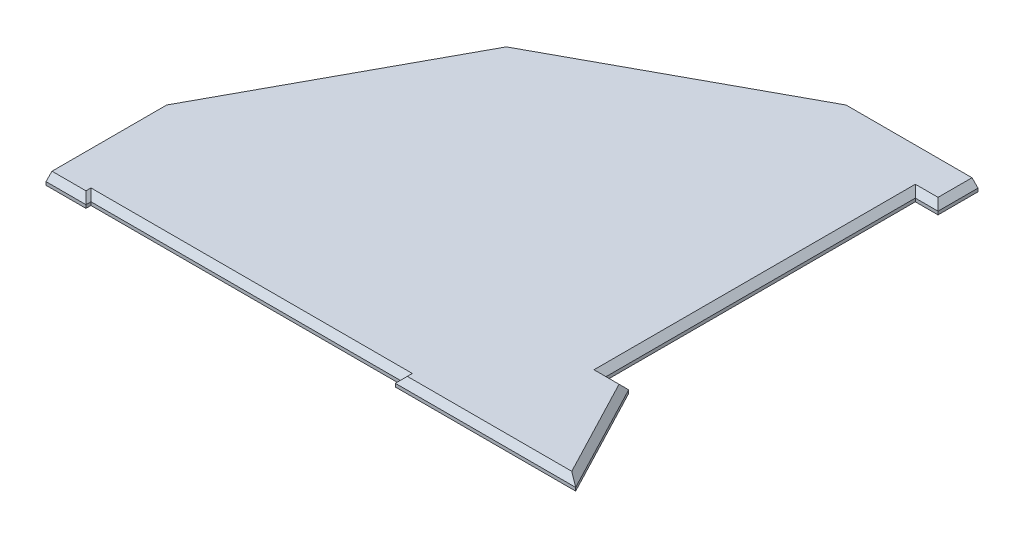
ISO-10303-21;
HEADER;
FILE_DESCRIPTION(('STEP AP214'),'2;1');
FILE_NAME('part.step','',(''),(''),'','','');
FILE_SCHEMA(('AUTOMOTIVE_DESIGN { 1 0 10303 214 1 1 1 1 }'));
ENDSEC;
DATA;
#1=APPLICATION_CONTEXT('core data for automotive mechanical design processes');
#2=APPLICATION_PROTOCOL_DEFINITION('international standard','automotive_design',2000,#1);
#3=PRODUCT_CONTEXT('',#1,'mechanical');
#4=PRODUCT('Part','Part','',(#3));
#5=PRODUCT_RELATED_PRODUCT_CATEGORY('part','',(#4));
#6=PRODUCT_DEFINITION_FORMATION('','',#4);
#7=PRODUCT_DEFINITION_CONTEXT('part definition',#1,'design');
#8=PRODUCT_DEFINITION('design','',#6,#7);
#9=PRODUCT_DEFINITION_SHAPE('','',#8);
#10=(LENGTH_UNIT() NAMED_UNIT(*) SI_UNIT(.MILLI.,.METRE.));
#11=(NAMED_UNIT(*) PLANE_ANGLE_UNIT() SI_UNIT($,.RADIAN.));
#12=(NAMED_UNIT(*) SI_UNIT($,.STERADIAN.) SOLID_ANGLE_UNIT());
#13=UNCERTAINTY_MEASURE_WITH_UNIT(LENGTH_MEASURE(1.E-05),#10,'distance_accuracy_value','');
#14=(GEOMETRIC_REPRESENTATION_CONTEXT(3) GLOBAL_UNCERTAINTY_ASSIGNED_CONTEXT((#13)) GLOBAL_UNIT_ASSIGNED_CONTEXT((#10,
#11,#12)) REPRESENTATION_CONTEXT('',''));
#15=CARTESIAN_POINT('',(0.,0.,0.));
#16=DIRECTION('',(0.,0.,1.));
#17=DIRECTION('',(1.,0.,0.));
#18=AXIS2_PLACEMENT_3D('',#15,#16,#17);
#19=CARTESIAN_POINT('',(145.16828136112,19.05,-591.552652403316));
#20=DIRECTION('',(0.476973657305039,0.,0.878917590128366));
#21=DIRECTION('',(0.878917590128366,0.,-0.47697365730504));
#22=AXIS2_PLACEMENT_3D('',#19,#20,#21);
#23=PLANE('',#22);
#24=DIRECTION('',(-0.878917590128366,0.,0.476973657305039));
#25=VECTOR('',#24,1.);
#26=CARTESIAN_POINT('',(145.16828136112,-19.05,-591.552652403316));
#27=LINE('',#26,#25);
#28=CARTESIAN_POINT('',(145.16828136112,-19.05,-591.552652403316));
#29=VERTEX_POINT('',#28);
#30=CARTESIAN_POINT('',(-405.744758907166,-19.05,-292.581496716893));
#31=VERTEX_POINT('',#30);
#32=EDGE_CURVE('E236',#29,#31,#27,.T.);
#33=ORIENTED_EDGE('',*,*,#32,.T.);
#34=DIRECTION('',(0.,-1.,0.));
#35=VECTOR('',#34,1.);
#36=CARTESIAN_POINT('',(-405.744758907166,19.05,-292.581496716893));
#37=LINE('',#36,#35);
#38=CARTESIAN_POINT('',(-405.744758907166,19.05,-292.581496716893));
#39=VERTEX_POINT('',#38);
#40=EDGE_CURVE('E218',#39,#31,#37,.T.);
#41=ORIENTED_EDGE('',*,*,#40,.F.);
#42=DIRECTION('',(-0.878917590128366,0.,0.476973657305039));
#43=VECTOR('',#42,1.);
#44=CARTESIAN_POINT('',(145.16828136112,19.05,-591.552652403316));
#45=LINE('',#44,#43);
#46=CARTESIAN_POINT('',(145.16828136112,19.05,-591.552652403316));
#47=VERTEX_POINT('',#46);
#48=EDGE_CURVE('E227',#47,#39,#45,.T.);
#49=ORIENTED_EDGE('',*,*,#48,.F.);
#50=DIRECTION('',(0.,-1.,0.));
#51=VECTOR('',#50,1.);
#52=CARTESIAN_POINT('',(145.16828136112,19.05,-591.552652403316));
#53=LINE('',#52,#51);
#54=EDGE_CURVE('E391',#47,#29,#53,.T.);
#55=ORIENTED_EDGE('',*,*,#54,.T.);
#56=EDGE_LOOP('',(#33,#41,#49,#55));
#57=FACE_BOUND('',#56,.T.);
#58=ADVANCED_FACE('F44',(#57),#23,.F.);
#59=CARTESIAN_POINT('',(-405.744758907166,19.05,-292.581496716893));
#60=DIRECTION('',(0.878917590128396,0.,0.476973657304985));
#61=DIRECTION('',(0.476973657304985,0.,-0.878917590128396));
#62=AXIS2_PLACEMENT_3D('',#59,#60,#61);
#63=PLANE('',#62);
#64=DIRECTION('',(-0.476973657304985,0.,0.878917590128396));
#65=VECTOR('',#64,1.);
#66=CARTESIAN_POINT('',(-405.744758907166,-19.05,-292.581496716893));
#67=LINE('',#66,#65);
#68=CARTESIAN_POINT('',(-704.715914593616,-19.05,258.331543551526));
#69=VERTEX_POINT('',#68);
#70=EDGE_CURVE('E402',#31,#69,#67,.T.);
#71=ORIENTED_EDGE('',*,*,#70,.T.);
#72=DIRECTION('',(0.,-1.,0.));
#73=VECTOR('',#72,1.);
#74=CARTESIAN_POINT('',(-704.715914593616,19.05,258.331543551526));
#75=LINE('',#74,#73);
#76=CARTESIAN_POINT('',(-704.715914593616,19.05,258.331543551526));
#77=VERTEX_POINT('',#76);
#78=EDGE_CURVE('E225',#77,#69,#75,.T.);
#79=ORIENTED_EDGE('',*,*,#78,.F.);
#80=DIRECTION('',(-0.476973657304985,0.,0.878917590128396));
#81=VECTOR('',#80,1.);
#82=CARTESIAN_POINT('',(-405.744758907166,19.05,-292.581496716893));
#83=LINE('',#82,#81);
#84=EDGE_CURVE('E214',#39,#77,#83,.T.);
#85=ORIENTED_EDGE('',*,*,#84,.F.);
#86=ORIENTED_EDGE('',*,*,#40,.T.);
#87=EDGE_LOOP('',(#71,#79,#85,#86));
#88=FACE_BOUND('',#87,.T.);
#89=ADVANCED_FACE('F220',(#88),#63,.F.);
#90=CARTESIAN_POINT('',(-704.715914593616,19.05,560.23764759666));
#91=DIRECTION('',(1.,0.,0.));
#92=DIRECTION('',(0.,0.,-1.));
#93=AXIS2_PLACEMENT_3D('',#90,#91,#92);
#94=PLANE('',#93);
#95=DIRECTION('',(0.,0.,1.));
#96=VECTOR('',#95,1.);
#97=CARTESIAN_POINT('',(-704.715914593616,-19.05,560.23764759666));
#98=LINE('',#97,#96);
#99=CARTESIAN_POINT('',(-704.715914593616,-19.05,545.23764759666));
#100=VERTEX_POINT('',#99);
#101=EDGE_CURVE('E401',#69,#100,#98,.T.);
#102=ORIENTED_EDGE('',*,*,#101,.T.);
#103=DIRECTION('',(0.,0.70710678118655,0.707106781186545));
#104=VECTOR('',#103,1.);
#105=CARTESIAN_POINT('',(-704.715914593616,-4.04999999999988,560.23764759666));
#106=LINE('',#105,#104);
#107=CARTESIAN_POINT('',(-704.715914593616,-4.04999999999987,560.23764759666));
#108=VERTEX_POINT('',#107);
#109=EDGE_CURVE('E271',#100,#108,#106,.T.);
#110=ORIENTED_EDGE('',*,*,#109,.T.);
#111=DIRECTION('',(0.,-1.,0.));
#112=VECTOR('',#111,1.);
#113=CARTESIAN_POINT('',(-704.715914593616,19.05,560.23764759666));
#114=LINE('',#113,#112);
#115=CARTESIAN_POINT('',(-704.715914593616,4.0500000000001,560.23764759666));
#116=VERTEX_POINT('',#115);
#117=EDGE_CURVE('E245',#116,#108,#114,.T.);
#118=ORIENTED_EDGE('',*,*,#117,.F.);
#119=DIRECTION('',(0.,-0.707106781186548,0.707106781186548));
#120=VECTOR('',#119,1.);
#121=CARTESIAN_POINT('',(-704.715914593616,19.05,545.23764759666));
#122=LINE('',#121,#120);
#123=CARTESIAN_POINT('',(-704.715914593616,19.05,545.23764759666));
#124=VERTEX_POINT('',#123);
#125=EDGE_CURVE('E267',#116,#124,#122,.F.);
#126=ORIENTED_EDGE('',*,*,#125,.T.);
#127=DIRECTION('',(0.,0.,1.));
#128=VECTOR('',#127,1.);
#129=CARTESIAN_POINT('',(-704.715914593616,19.05,560.23764759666));
#130=LINE('',#129,#128);
#131=EDGE_CURVE('E223',#77,#124,#130,.T.);
#132=ORIENTED_EDGE('',*,*,#131,.F.);
#133=ORIENTED_EDGE('',*,*,#78,.T.);
#134=EDGE_LOOP('',(#102,#110,#118,#126,#132,#133));
#135=FACE_BOUND('',#134,.T.);
#136=ADVANCED_FACE('F526',(#135),#94,.F.);
#137=CARTESIAN_POINT('',(-604.715914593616,19.05,560.23764759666));
#138=DIRECTION('',(0.,0.,-1.));
#139=DIRECTION('',(-1.,0.,0.));
#140=AXIS2_PLACEMENT_3D('',#137,#138,#139);
#141=PLANE('',#140);
#142=ORIENTED_EDGE('',*,*,#117,.T.);
#143=DIRECTION('',(1.,0.,0.));
#144=VECTOR('',#143,1.);
#145=CARTESIAN_POINT('',(-604.715914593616,-4.04999999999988,560.23764759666));
#146=LINE('',#145,#144);
#147=CARTESIAN_POINT('',(-604.715914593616,-4.04999999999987,560.23764759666));
#148=VERTEX_POINT('',#147);
#149=EDGE_CURVE('E242',#108,#148,#146,.T.);
#150=ORIENTED_EDGE('',*,*,#149,.T.);
#151=DIRECTION('',(0.,-1.,0.));
#152=VECTOR('',#151,1.);
#153=CARTESIAN_POINT('',(-604.715914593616,19.05,560.23764759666));
#154=LINE('',#153,#152);
#155=CARTESIAN_POINT('',(-604.715914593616,4.0500000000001,560.23764759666));
#156=VERTEX_POINT('',#155);
#157=EDGE_CURVE('E435',#156,#148,#154,.T.);
#158=ORIENTED_EDGE('',*,*,#157,.F.);
#159=DIRECTION('',(-1.,0.,0.));
#160=VECTOR('',#159,1.);
#161=CARTESIAN_POINT('',(-604.715914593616,4.0500000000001,560.23764759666));
#162=LINE('',#161,#160);
#163=EDGE_CURVE('E239',#156,#116,#162,.T.);
#164=ORIENTED_EDGE('',*,*,#163,.T.);
#165=EDGE_LOOP('',(#142,#150,#158,#164));
#166=FACE_BOUND('',#165,.T.);
#167=ADVANCED_FACE('F437',(#166),#141,.F.);
#168=CARTESIAN_POINT('',(-604.715914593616,19.05,547.71264759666));
#169=DIRECTION('',(-1.,0.,0.));
#170=DIRECTION('',(0.,0.,1.));
#171=AXIS2_PLACEMENT_3D('',#168,#169,#170);
#172=PLANE('',#171);
#173=ORIENTED_EDGE('',*,*,#157,.T.);
#174=DIRECTION('',(0.,0.,-1.));
#175=VECTOR('',#174,1.);
#176=CARTESIAN_POINT('',(-604.715914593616,-4.04999999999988,547.71264759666));
#177=LINE('',#176,#175);
#178=CARTESIAN_POINT('',(-604.715914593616,-4.04999999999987,547.71264759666));
#179=VERTEX_POINT('',#178);
#180=EDGE_CURVE('E274',#148,#179,#177,.T.);
#181=ORIENTED_EDGE('',*,*,#180,.T.);
#182=DIRECTION('',(0.,-1.,0.));
#183=VECTOR('',#182,1.);
#184=CARTESIAN_POINT('',(-604.715914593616,19.05,547.71264759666));
#185=LINE('',#184,#183);
#186=CARTESIAN_POINT('',(-604.715914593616,4.0500000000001,547.71264759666));
#187=VERTEX_POINT('',#186);
#188=EDGE_CURVE('E427',#187,#179,#185,.T.);
#189=ORIENTED_EDGE('',*,*,#188,.F.);
#190=DIRECTION('',(0.,0.,1.));
#191=VECTOR('',#190,1.);
#192=CARTESIAN_POINT('',(-604.715914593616,4.0500000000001,547.71264759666));
#193=LINE('',#192,#191);
#194=EDGE_CURVE('E272',#187,#156,#193,.T.);
#195=ORIENTED_EDGE('',*,*,#194,.T.);
#196=EDGE_LOOP('',(#173,#181,#189,#195));
#197=FACE_BOUND('',#196,.T.);
#198=ADVANCED_FACE('F455',(#197),#172,.F.);
#199=CARTESIAN_POINT('',(-604.715914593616,19.05,547.71264759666));
#200=DIRECTION('',(0.,0.,-1.));
#201=DIRECTION('',(-1.,0.,0.));
#202=AXIS2_PLACEMENT_3D('',#199,#200,#201);
#203=PLANE('',#202);
#204=ORIENTED_EDGE('',*,*,#188,.T.);
#205=DIRECTION('',(1.,0.,0.));
#206=VECTOR('',#205,1.);
#207=CARTESIAN_POINT('',(169.284085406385,-4.04999999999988,547.71264759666));
#208=LINE('',#207,#206);
#209=CARTESIAN_POINT('',(169.284085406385,-4.04999999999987,547.71264759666));
#210=VERTEX_POINT('',#209);
#211=EDGE_CURVE('E276',#179,#210,#208,.T.);
#212=ORIENTED_EDGE('',*,*,#211,.T.);
#213=DIRECTION('',(0.,-1.,0.));
#214=VECTOR('',#213,1.);
#215=CARTESIAN_POINT('',(169.284085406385,19.05,547.71264759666));
#216=LINE('',#215,#214);
#217=CARTESIAN_POINT('',(169.284085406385,4.0500000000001,547.71264759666));
#218=VERTEX_POINT('',#217);
#219=EDGE_CURVE('E426',#218,#210,#216,.T.);
#220=ORIENTED_EDGE('',*,*,#219,.F.);
#221=DIRECTION('',(-1.,0.,0.));
#222=VECTOR('',#221,1.);
#223=CARTESIAN_POINT('',(-604.715914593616,4.0500000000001,547.71264759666));
#224=LINE('',#223,#222);
#225=EDGE_CURVE('E280',#218,#187,#224,.T.);
#226=ORIENTED_EDGE('',*,*,#225,.T.);
#227=EDGE_LOOP('',(#204,#212,#220,#226));
#228=FACE_BOUND('',#227,.T.);
#229=ADVANCED_FACE('F456',(#228),#203,.F.);
#230=CARTESIAN_POINT('',(169.284085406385,19.05,547.71264759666));
#231=DIRECTION('',(1.,0.,0.));
#232=DIRECTION('',(0.,0.,-1.));
#233=AXIS2_PLACEMENT_3D('',#230,#231,#232);
#234=PLANE('',#233);
#235=ORIENTED_EDGE('',*,*,#219,.T.);
#236=DIRECTION('',(0.,0.,1.));
#237=VECTOR('',#236,1.);
#238=CARTESIAN_POINT('',(169.284085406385,-4.04999999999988,560.23764759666));
#239=LINE('',#238,#237);
#240=CARTESIAN_POINT('',(169.284085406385,-4.04999999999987,560.23764759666));
#241=VERTEX_POINT('',#240);
#242=EDGE_CURVE('E285',#210,#241,#239,.T.);
#243=ORIENTED_EDGE('',*,*,#242,.T.);
#244=DIRECTION('',(0.,-1.,0.));
#245=VECTOR('',#244,1.);
#246=CARTESIAN_POINT('',(169.284085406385,19.05,560.23764759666));
#247=LINE('',#246,#245);
#248=CARTESIAN_POINT('',(169.284085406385,4.0500000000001,560.23764759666));
#249=VERTEX_POINT('',#248);
#250=EDGE_CURVE('E421',#249,#241,#247,.T.);
#251=ORIENTED_EDGE('',*,*,#250,.F.);
#252=DIRECTION('',(0.,0.,-1.));
#253=VECTOR('',#252,1.);
#254=CARTESIAN_POINT('',(169.284085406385,4.0500000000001,547.71264759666));
#255=LINE('',#254,#253);
#256=EDGE_CURVE('E282',#249,#218,#255,.T.);
#257=ORIENTED_EDGE('',*,*,#256,.T.);
#258=EDGE_LOOP('',(#235,#243,#251,#257));
#259=FACE_BOUND('',#258,.T.);
#260=ADVANCED_FACE('F472',(#259),#234,.F.);
#261=CARTESIAN_POINT('',(620.484085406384,19.05,560.23764759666));
#262=DIRECTION('',(0.,0.,-1.));
#263=DIRECTION('',(-1.,0.,0.));
#264=AXIS2_PLACEMENT_3D('',#261,#262,#263);
#265=PLANE('',#264);
#266=ORIENTED_EDGE('',*,*,#250,.T.);
#267=DIRECTION('',(1.,0.,0.));
#268=VECTOR('',#267,1.);
#269=CARTESIAN_POINT('',(620.484085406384,-4.04999999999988,560.23764759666));
#270=LINE('',#269,#268);
#271=CARTESIAN_POINT('',(620.484085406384,-4.04999999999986,560.23764759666));
#272=VERTEX_POINT('',#271);
#273=EDGE_CURVE('E289',#241,#272,#270,.T.);
#274=ORIENTED_EDGE('',*,*,#273,.T.);
#275=DIRECTION('',(0.,-1.,0.));
#276=VECTOR('',#275,1.);
#277=CARTESIAN_POINT('',(620.484085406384,19.05,560.23764759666));
#278=LINE('',#277,#276);
#279=CARTESIAN_POINT('',(620.484085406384,4.05000000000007,560.23764759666));
#280=VERTEX_POINT('',#279);
#281=EDGE_CURVE('E419',#280,#272,#278,.T.);
#282=ORIENTED_EDGE('',*,*,#281,.F.);
#283=DIRECTION('',(-1.,0.,0.));
#284=VECTOR('',#283,1.);
#285=CARTESIAN_POINT('',(620.484085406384,4.0500000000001,560.23764759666));
#286=LINE('',#285,#284);
#287=EDGE_CURVE('E283',#280,#249,#286,.T.);
#288=ORIENTED_EDGE('',*,*,#287,.T.);
#289=EDGE_LOOP('',(#266,#274,#282,#288));
#290=FACE_BOUND('',#289,.T.);
#291=ADVANCED_FACE('F478',(#290),#265,.F.);
#292=CARTESIAN_POINT('',(620.484085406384,19.05,560.23764759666));
#293=DIRECTION('',(-0.886253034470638,0.,0.463201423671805));
#294=DIRECTION('',(0.463201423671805,0.,0.886253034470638));
#295=AXIS2_PLACEMENT_3D('',#292,#293,#294);
#296=PLANE('',#295);
#297=ORIENTED_EDGE('',*,*,#281,.T.);
#298=DIRECTION('',(-0.463201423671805,0.,-0.886253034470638));
#299=VECTOR('',#298,1.);
#300=CARTESIAN_POINT('',(475.296585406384,-4.04999999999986,282.447347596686));
#301=LINE('',#300,#299);
#302=CARTESIAN_POINT('',(475.296585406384,-4.04999999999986,282.447347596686));
#303=VERTEX_POINT('',#302);
#304=EDGE_CURVE('E313',#272,#303,#301,.T.);
#305=ORIENTED_EDGE('',*,*,#304,.T.);
#306=DIRECTION('',(0.,-1.,0.));
#307=VECTOR('',#306,1.);
#308=CARTESIAN_POINT('',(475.296585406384,19.05,282.447347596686));
#309=LINE('',#308,#307);
#310=CARTESIAN_POINT('',(475.296585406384,4.05000000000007,282.447347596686));
#311=VERTEX_POINT('',#310);
#312=EDGE_CURVE('E417',#311,#303,#309,.T.);
#313=ORIENTED_EDGE('',*,*,#312,.F.);
#314=DIRECTION('',(0.463201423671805,0.,0.886253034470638));
#315=VECTOR('',#314,1.);
#316=CARTESIAN_POINT('',(620.484085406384,4.05000000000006,560.23764759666));
#317=LINE('',#316,#315);
#318=EDGE_CURVE('E310',#311,#280,#317,.T.);
#319=ORIENTED_EDGE('',*,*,#318,.T.);
#320=EDGE_LOOP('',(#297,#305,#313,#319));
#321=FACE_BOUND('',#320,.T.);
#322=ADVANCED_FACE('F489',(#321),#296,.F.);
#323=CARTESIAN_POINT('',(418.496585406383,19.05,282.447347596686));
#324=DIRECTION('',(0.,0.,1.));
#325=DIRECTION('',(1.,0.,0.));
#326=AXIS2_PLACEMENT_3D('',#323,#324,#325);
#327=PLANE('',#326);
#328=ORIENTED_EDGE('',*,*,#312,.T.);
#329=DIRECTION('',(-1.,0.,0.));
#330=VECTOR('',#329,1.);
#331=CARTESIAN_POINT('',(418.496585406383,-4.04999999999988,282.447347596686));
#332=LINE('',#331,#330);
#333=CARTESIAN_POINT('',(418.496585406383,-4.04999999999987,282.447347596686));
#334=VERTEX_POINT('',#333);
#335=EDGE_CURVE('E307',#303,#334,#332,.T.);
#336=ORIENTED_EDGE('',*,*,#335,.T.);
#337=DIRECTION('',(0.,-1.,0.));
#338=VECTOR('',#337,1.);
#339=CARTESIAN_POINT('',(418.496585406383,19.05,282.447347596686));
#340=LINE('',#339,#338);
#341=CARTESIAN_POINT('',(418.496585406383,4.0500000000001,282.447347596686));
#342=VERTEX_POINT('',#341);
#343=EDGE_CURVE('E415',#342,#334,#340,.T.);
#344=ORIENTED_EDGE('',*,*,#343,.F.);
#345=DIRECTION('',(1.,0.,0.));
#346=VECTOR('',#345,1.);
#347=CARTESIAN_POINT('',(418.496585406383,4.0500000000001,282.447347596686));
#348=LINE('',#347,#346);
#349=EDGE_CURVE('E301',#342,#311,#348,.T.);
#350=ORIENTED_EDGE('',*,*,#349,.T.);
#351=EDGE_LOOP('',(#328,#336,#344,#350));
#352=FACE_BOUND('',#351,.T.);
#353=ADVANCED_FACE('F493',(#352),#327,.F.);
#354=CARTESIAN_POINT('',(418.496585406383,19.05,282.447347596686));
#355=DIRECTION('',(-1.,0.,0.));
#356=DIRECTION('',(0.,0.,1.));
#357=AXIS2_PLACEMENT_3D('',#354,#355,#356);
#358=PLANE('',#357);
#359=ORIENTED_EDGE('',*,*,#343,.T.);
#360=DIRECTION('',(0.,0.,-1.));
#361=VECTOR('',#360,1.);
#362=CARTESIAN_POINT('',(418.496585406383,-4.04999999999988,-491.552652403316));
#363=LINE('',#362,#361);
#364=CARTESIAN_POINT('',(418.496585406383,-4.04999999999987,-491.552652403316));
#365=VERTEX_POINT('',#364);
#366=EDGE_CURVE('E302',#334,#365,#363,.T.);
#367=ORIENTED_EDGE('',*,*,#366,.T.);
#368=DIRECTION('',(0.,-1.,0.));
#369=VECTOR('',#368,1.);
#370=CARTESIAN_POINT('',(418.496585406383,19.05,-491.552652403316));
#371=LINE('',#370,#369);
#372=CARTESIAN_POINT('',(418.496585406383,4.0500000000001,-491.552652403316));
#373=VERTEX_POINT('',#372);
#374=EDGE_CURVE('E413',#373,#365,#371,.T.);
#375=ORIENTED_EDGE('',*,*,#374,.F.);
#376=DIRECTION('',(0.,0.,1.));
#377=VECTOR('',#376,1.);
#378=CARTESIAN_POINT('',(418.496585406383,4.0500000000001,282.447347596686));
#379=LINE('',#378,#377);
#380=EDGE_CURVE('E303',#373,#342,#379,.T.);
#381=ORIENTED_EDGE('',*,*,#380,.T.);
#382=EDGE_LOOP('',(#359,#367,#375,#381));
#383=FACE_BOUND('',#382,.T.);
#384=ADVANCED_FACE('F507',(#383),#358,.F.);
#385=CARTESIAN_POINT('',(418.496585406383,19.05,-491.552652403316));
#386=DIRECTION('',(0.,0.,-1.));
#387=DIRECTION('',(-1.,0.,0.));
#388=AXIS2_PLACEMENT_3D('',#385,#386,#387);
#389=PLANE('',#388);
#390=ORIENTED_EDGE('',*,*,#374,.T.);
#391=DIRECTION('',(1.,0.,0.));
#392=VECTOR('',#391,1.);
#393=CARTESIAN_POINT('',(475.296585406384,-4.04999999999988,-491.552652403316));
#394=LINE('',#393,#392);
#395=CARTESIAN_POINT('',(475.296585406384,-4.04999999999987,-491.552652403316));
#396=VERTEX_POINT('',#395);
#397=EDGE_CURVE('E296',#365,#396,#394,.T.);
#398=ORIENTED_EDGE('',*,*,#397,.T.);
#399=DIRECTION('',(0.,-1.,0.));
#400=VECTOR('',#399,1.);
#401=CARTESIAN_POINT('',(475.296585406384,19.05,-491.552652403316));
#402=LINE('',#401,#400);
#403=CARTESIAN_POINT('',(475.296585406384,4.0500000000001,-491.552652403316));
#404=VERTEX_POINT('',#403);
#405=EDGE_CURVE('E410',#404,#396,#402,.T.);
#406=ORIENTED_EDGE('',*,*,#405,.F.);
#407=DIRECTION('',(-1.,0.,0.));
#408=VECTOR('',#407,1.);
#409=CARTESIAN_POINT('',(418.496585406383,4.0500000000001,-491.552652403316));
#410=LINE('',#409,#408);
#411=EDGE_CURVE('E299',#404,#373,#410,.T.);
#412=ORIENTED_EDGE('',*,*,#411,.T.);
#413=EDGE_LOOP('',(#390,#398,#406,#412));
#414=FACE_BOUND('',#413,.T.);
#415=ADVANCED_FACE('F512',(#414),#389,.F.);
#416=CARTESIAN_POINT('',(475.296585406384,19.05,-491.552652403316));
#417=DIRECTION('',(-1.,0.,0.));
#418=DIRECTION('',(0.,0.,1.));
#419=AXIS2_PLACEMENT_3D('',#416,#417,#418);
#420=PLANE('',#419);
#421=ORIENTED_EDGE('',*,*,#405,.T.);
#422=DIRECTION('',(0.,0.,-1.));
#423=VECTOR('',#422,1.);
#424=CARTESIAN_POINT('',(475.296585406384,-4.04999999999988,-591.552652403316));
#425=LINE('',#424,#423);
#426=CARTESIAN_POINT('',(475.296585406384,-4.04999999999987,-591.552652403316));
#427=VERTEX_POINT('',#426);
#428=EDGE_CURVE('E292',#396,#427,#425,.T.);
#429=ORIENTED_EDGE('',*,*,#428,.T.);
#430=DIRECTION('',(0.,-1.,0.));
#431=VECTOR('',#430,1.);
#432=CARTESIAN_POINT('',(475.296585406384,19.05,-591.552652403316));
#433=LINE('',#432,#431);
#434=CARTESIAN_POINT('',(475.296585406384,4.0500000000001,-591.552652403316));
#435=VERTEX_POINT('',#434);
#436=EDGE_CURVE('E398',#435,#427,#433,.T.);
#437=ORIENTED_EDGE('',*,*,#436,.F.);
#438=DIRECTION('',(0.,0.,1.));
#439=VECTOR('',#438,1.);
#440=CARTESIAN_POINT('',(475.296585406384,4.0500000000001,-491.552652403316));
#441=LINE('',#440,#439);
#442=EDGE_CURVE('E290',#435,#404,#441,.T.);
#443=ORIENTED_EDGE('',*,*,#442,.T.);
#444=EDGE_LOOP('',(#421,#429,#437,#443));
#445=FACE_BOUND('',#444,.T.);
#446=ADVANCED_FACE('F522',(#445),#420,.F.);
#447=CARTESIAN_POINT('',(475.296585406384,19.05,-591.552652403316));
#448=DIRECTION('',(0.,0.,1.));
#449=DIRECTION('',(1.,0.,0.));
#450=AXIS2_PLACEMENT_3D('',#447,#448,#449);
#451=PLANE('',#450);
#452=ORIENTED_EDGE('',*,*,#436,.T.);
#453=DIRECTION('',(-0.707106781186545,-0.70710678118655,0.));
#454=VECTOR('',#453,1.);
#455=CARTESIAN_POINT('',(475.296585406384,-4.04999999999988,-591.552652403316));
#456=LINE('',#455,#454);
#457=CARTESIAN_POINT('',(460.296585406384,-19.05,-591.552652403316));
#458=VERTEX_POINT('',#457);
#459=EDGE_CURVE('E293',#427,#458,#456,.T.);
#460=ORIENTED_EDGE('',*,*,#459,.T.);
#461=DIRECTION('',(-1.,0.,0.));
#462=VECTOR('',#461,1.);
#463=CARTESIAN_POINT('',(475.296585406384,-19.05,-591.552652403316));
#464=LINE('',#463,#462);
#465=EDGE_CURVE('E231',#458,#29,#464,.T.);
#466=ORIENTED_EDGE('',*,*,#465,.T.);
#467=ORIENTED_EDGE('',*,*,#54,.F.);
#468=DIRECTION('',(-1.,0.,0.));
#469=VECTOR('',#468,1.);
#470=CARTESIAN_POINT('',(475.296585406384,19.05,-591.552652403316));
#471=LINE('',#470,#469);
#472=CARTESIAN_POINT('',(460.296585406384,19.05,-591.552652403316));
#473=VERTEX_POINT('',#472);
#474=EDGE_CURVE('E233',#473,#47,#471,.T.);
#475=ORIENTED_EDGE('',*,*,#474,.F.);
#476=DIRECTION('',(-0.707106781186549,0.707106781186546,0.));
#477=VECTOR('',#476,1.);
#478=CARTESIAN_POINT('',(460.296585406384,19.05,-591.552652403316));
#479=LINE('',#478,#477);
#480=EDGE_CURVE('E291',#473,#435,#479,.F.);
#481=ORIENTED_EDGE('',*,*,#480,.T.);
#482=EDGE_LOOP('',(#452,#460,#466,#467,#475,#481));
#483=FACE_BOUND('',#482,.T.);
#484=ADVANCED_FACE('F394',(#483),#451,.F.);
#485=CARTESIAN_POINT('',(0.,19.05,0.));
#486=DIRECTION('',(0.,-1.,0.));
#487=DIRECTION('',(0.,0.,-1.));
#488=AXIS2_PLACEMENT_3D('',#485,#486,#487);
#489=PLANE('',#488);
#490=ORIENTED_EDGE('',*,*,#131,.T.);
#491=DIRECTION('',(1.,0.,0.));
#492=VECTOR('',#491,1.);
#493=CARTESIAN_POINT('',(0.,19.05,545.23764759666));
#494=LINE('',#493,#492);
#495=CARTESIAN_POINT('',(-619.715914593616,19.05,545.23764759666));
#496=VERTEX_POINT('',#495);
#497=EDGE_CURVE('E11',#124,#496,#494,.T.);
#498=ORIENTED_EDGE('',*,*,#497,.T.);
#499=DIRECTION('',(0.,0.,-1.));
#500=VECTOR('',#499,1.);
#501=CARTESIAN_POINT('',(-619.715914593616,19.05,0.));
#502=LINE('',#501,#500);
#503=CARTESIAN_POINT('',(-619.715914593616,19.05,532.71264759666));
#504=VERTEX_POINT('',#503);
#505=EDGE_CURVE('E54',#496,#504,#502,.T.);
#506=ORIENTED_EDGE('',*,*,#505,.T.);
#507=DIRECTION('',(1.,0.,0.));
#508=VECTOR('',#507,1.);
#509=CARTESIAN_POINT('',(0.,19.05,532.71264759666));
#510=LINE('',#509,#508);
#511=CARTESIAN_POINT('',(184.284085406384,19.05,532.71264759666));
#512=VERTEX_POINT('',#511);
#513=EDGE_CURVE('E330',#504,#512,#510,.T.);
#514=ORIENTED_EDGE('',*,*,#513,.T.);
#515=DIRECTION('',(0.,0.,1.));
#516=VECTOR('',#515,1.);
#517=CARTESIAN_POINT('',(184.284085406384,19.05,0.));
#518=LINE('',#517,#516);
#519=CARTESIAN_POINT('',(184.284085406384,19.05,545.23764759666));
#520=VERTEX_POINT('',#519);
#521=EDGE_CURVE('E324',#512,#520,#518,.T.);
#522=ORIENTED_EDGE('',*,*,#521,.T.);
#523=DIRECTION('',(1.,0.,0.));
#524=VECTOR('',#523,1.);
#525=CARTESIAN_POINT('',(0.,19.05,545.23764759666));
#526=LINE('',#525,#524);
#527=CARTESIAN_POINT('',(595.719124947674,19.05,545.23764759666));
#528=VERTEX_POINT('',#527);
#529=EDGE_CURVE('E323',#520,#528,#526,.T.);
#530=ORIENTED_EDGE('',*,*,#529,.T.);
#531=DIRECTION('',(-0.463201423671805,0.,-0.886253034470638));
#532=VECTOR('',#531,1.);
#533=CARTESIAN_POINT('',(244.076768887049,19.05,-127.567074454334));
#534=LINE('',#533,#532);
#535=CARTESIAN_POINT('',(466.21116811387,19.05,297.447347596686));
#536=VERTEX_POINT('',#535);
#537=EDGE_CURVE('E311',#528,#536,#534,.T.);
#538=ORIENTED_EDGE('',*,*,#537,.T.);
#539=DIRECTION('',(-1.,0.,0.));
#540=VECTOR('',#539,1.);
#541=CARTESIAN_POINT('',(0.,19.05,297.447347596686));
#542=LINE('',#541,#540);
#543=CARTESIAN_POINT('',(403.496585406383,19.05,297.447347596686));
#544=VERTEX_POINT('',#543);
#545=EDGE_CURVE('E312',#536,#544,#542,.T.);
#546=ORIENTED_EDGE('',*,*,#545,.T.);
#547=DIRECTION('',(0.,0.,-1.));
#548=VECTOR('',#547,1.);
#549=CARTESIAN_POINT('',(403.496585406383,19.05,0.));
#550=LINE('',#549,#548);
#551=CARTESIAN_POINT('',(403.496585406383,19.05,-506.552652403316));
#552=VERTEX_POINT('',#551);
#553=EDGE_CURVE('E320',#544,#552,#550,.T.);
#554=ORIENTED_EDGE('',*,*,#553,.T.);
#555=DIRECTION('',(1.,0.,0.));
#556=VECTOR('',#555,1.);
#557=CARTESIAN_POINT('',(0.,19.05,-506.552652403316));
#558=LINE('',#557,#556);
#559=CARTESIAN_POINT('',(460.296585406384,19.05,-506.552652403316));
#560=VERTEX_POINT('',#559);
#561=EDGE_CURVE('E317',#552,#560,#558,.T.);
#562=ORIENTED_EDGE('',*,*,#561,.T.);
#563=DIRECTION('',(0.,0.,-1.));
#564=VECTOR('',#563,1.);
#565=CARTESIAN_POINT('',(460.296585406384,19.05,0.));
#566=LINE('',#565,#564);
#567=EDGE_CURVE('E321',#560,#473,#566,.T.);
#568=ORIENTED_EDGE('',*,*,#567,.T.);
#569=ORIENTED_EDGE('',*,*,#474,.T.);
#570=ORIENTED_EDGE('',*,*,#48,.T.);
#571=ORIENTED_EDGE('',*,*,#84,.T.);
#572=EDGE_LOOP('',(#490,#498,#506,#514,#522,#530,#538,#546,#554,#562,#568,#569,#570,#571));
#573=FACE_BOUND('',#572,.T.);
#574=ADVANCED_FACE('F226',(#573),#489,.F.);
#575=CARTESIAN_POINT('',(0.,-19.05,0.));
#576=DIRECTION('',(0.,-1.,0.));
#577=DIRECTION('',(0.,0.,-1.));
#578=AXIS2_PLACEMENT_3D('',#575,#576,#577);
#579=PLANE('',#578);
#580=DIRECTION('',(0.,0.,1.));
#581=VECTOR('',#580,1.);
#582=CARTESIAN_POINT('',(-619.715914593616,-19.05,560.23764759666));
#583=LINE('',#582,#581);
#584=CARTESIAN_POINT('',(-619.715914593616,-19.05,532.71264759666));
#585=VERTEX_POINT('',#584);
#586=CARTESIAN_POINT('',(-619.715914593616,-19.05,545.23764759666));
#587=VERTEX_POINT('',#586);
#588=EDGE_CURVE('E264',#585,#587,#583,.T.);
#589=ORIENTED_EDGE('',*,*,#588,.T.);
#590=DIRECTION('',(-1.,0.,0.));
#591=VECTOR('',#590,1.);
#592=CARTESIAN_POINT('',(-704.715914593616,-19.05,545.23764759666));
#593=LINE('',#592,#591);
#594=EDGE_CURVE('E270',#587,#100,#593,.T.);
#595=ORIENTED_EDGE('',*,*,#594,.T.);
#596=ORIENTED_EDGE('',*,*,#101,.F.);
#597=ORIENTED_EDGE('',*,*,#70,.F.);
#598=ORIENTED_EDGE('',*,*,#32,.F.);
#599=ORIENTED_EDGE('',*,*,#465,.F.);
#600=DIRECTION('',(0.,0.,1.));
#601=VECTOR('',#600,1.);
#602=CARTESIAN_POINT('',(460.296585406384,-19.05,-491.552652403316));
#603=LINE('',#602,#601);
#604=CARTESIAN_POINT('',(460.296585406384,-19.05,-506.552652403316));
#605=VERTEX_POINT('',#604);
#606=EDGE_CURVE('E260',#458,#605,#603,.T.);
#607=ORIENTED_EDGE('',*,*,#606,.T.);
#608=DIRECTION('',(-1.,0.,0.));
#609=VECTOR('',#608,1.);
#610=CARTESIAN_POINT('',(418.496585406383,-19.05,-506.552652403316));
#611=LINE('',#610,#609);
#612=CARTESIAN_POINT('',(403.496585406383,-19.05,-506.552652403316));
#613=VERTEX_POINT('',#612);
#614=EDGE_CURVE('E254',#605,#613,#611,.T.);
#615=ORIENTED_EDGE('',*,*,#614,.T.);
#616=DIRECTION('',(0.,0.,1.));
#617=VECTOR('',#616,1.);
#618=CARTESIAN_POINT('',(403.496585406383,-19.05,282.447347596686));
#619=LINE('',#618,#617);
#620=CARTESIAN_POINT('',(403.496585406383,-19.05,297.447347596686));
#621=VERTEX_POINT('',#620);
#622=EDGE_CURVE('E251',#613,#621,#619,.T.);
#623=ORIENTED_EDGE('',*,*,#622,.T.);
#624=DIRECTION('',(1.,0.,0.));
#625=VECTOR('',#624,1.);
#626=CARTESIAN_POINT('',(475.296585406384,-19.05,297.447347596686));
#627=LINE('',#626,#625);
#628=CARTESIAN_POINT('',(466.21116811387,-19.05,297.447347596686));
#629=VERTEX_POINT('',#628);
#630=EDGE_CURVE('E253',#621,#629,#627,.T.);
#631=ORIENTED_EDGE('',*,*,#630,.T.);
#632=DIRECTION('',(0.463201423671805,0.,0.886253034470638));
#633=VECTOR('',#632,1.);
#634=CARTESIAN_POINT('',(607.190289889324,-19.05,567.185668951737));
#635=LINE('',#634,#633);
#636=CARTESIAN_POINT('',(595.719124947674,-19.05,545.23764759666));
#637=VERTEX_POINT('',#636);
#638=EDGE_CURVE('E250',#629,#637,#635,.T.);
#639=ORIENTED_EDGE('',*,*,#638,.T.);
#640=DIRECTION('',(-1.,0.,0.));
#641=VECTOR('',#640,1.);
#642=CARTESIAN_POINT('',(169.284085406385,-19.05,545.23764759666));
#643=LINE('',#642,#641);
#644=CARTESIAN_POINT('',(184.284085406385,-19.05,545.23764759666));
#645=VERTEX_POINT('',#644);
#646=EDGE_CURVE('E259',#637,#645,#643,.T.);
#647=ORIENTED_EDGE('',*,*,#646,.T.);
#648=DIRECTION('',(0.,0.,-1.));
#649=VECTOR('',#648,1.);
#650=CARTESIAN_POINT('',(184.284085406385,-19.05,547.71264759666));
#651=LINE('',#650,#649);
#652=CARTESIAN_POINT('',(184.284085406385,-19.05,532.71264759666));
#653=VERTEX_POINT('',#652);
#654=EDGE_CURVE('E261',#645,#653,#651,.T.);
#655=ORIENTED_EDGE('',*,*,#654,.T.);
#656=DIRECTION('',(-1.,0.,0.));
#657=VECTOR('',#656,1.);
#658=CARTESIAN_POINT('',(-604.715914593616,-19.05,532.71264759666));
#659=LINE('',#658,#657);
#660=EDGE_CURVE('E263',#653,#585,#659,.T.);
#661=ORIENTED_EDGE('',*,*,#660,.T.);
#662=EDGE_LOOP('',(#589,#595,#596,#597,#598,#599,#607,#615,#623,#631,#639,#647,#655,#661));
#663=FACE_BOUND('',#662,.T.);
#664=ADVANCED_FACE('F528',(#663),#579,.T.);
#665=CARTESIAN_POINT('',(475.296585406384,-4.04999999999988,-491.552652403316));
#666=DIRECTION('',(0.70710678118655,-0.707106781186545,0.));
#667=DIRECTION('',(0.,0.,1.));
#668=AXIS2_PLACEMENT_3D('',#665,#666,#667);
#669=PLANE('',#668);
#670=ORIENTED_EDGE('',*,*,#459,.F.);
#671=ORIENTED_EDGE('',*,*,#428,.F.);
#672=DIRECTION('',(0.577350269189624,0.577350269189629,0.577350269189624));
#673=VECTOR('',#672,1.);
#674=CARTESIAN_POINT('',(456.363252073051,-22.9833333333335,-510.485985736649));
#675=LINE('',#674,#673);
#676=EDGE_CURVE('E355',#605,#396,#675,.T.);
#677=ORIENTED_EDGE('',*,*,#676,.F.);
#678=ORIENTED_EDGE('',*,*,#606,.F.);
#679=EDGE_LOOP('',(#670,#671,#677,#678));
#680=FACE_BOUND('',#679,.T.);
#681=ADVANCED_FACE('F523',(#680),#669,.T.);
#682=CARTESIAN_POINT('',(418.496585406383,-4.04999999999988,-491.552652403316));
#683=DIRECTION('',(0.,-0.707106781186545,0.70710678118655));
#684=DIRECTION('',(-1.,0.,0.));
#685=AXIS2_PLACEMENT_3D('',#682,#683,#684);
#686=PLANE('',#685);
#687=ORIENTED_EDGE('',*,*,#676,.T.);
#688=ORIENTED_EDGE('',*,*,#397,.F.);
#689=DIRECTION('',(0.577350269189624,0.577350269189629,0.577350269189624));
#690=VECTOR('',#689,1.);
#691=CARTESIAN_POINT('',(418.496585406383,-4.04999999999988,-491.552652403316));
#692=LINE('',#691,#690);
#693=EDGE_CURVE('E348',#613,#365,#692,.T.);
#694=ORIENTED_EDGE('',*,*,#693,.F.);
#695=ORIENTED_EDGE('',*,*,#614,.F.);
#696=EDGE_LOOP('',(#687,#688,#694,#695));
#697=FACE_BOUND('',#696,.T.);
#698=ADVANCED_FACE('F514',(#697),#686,.T.);
#699=CARTESIAN_POINT('',(418.496585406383,-4.04999999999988,282.447347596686));
#700=DIRECTION('',(0.70710678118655,-0.707106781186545,0.));
#701=DIRECTION('',(0.,0.,1.));
#702=AXIS2_PLACEMENT_3D('',#699,#700,#701);
#703=PLANE('',#702);
#704=ORIENTED_EDGE('',*,*,#693,.T.);
#705=ORIENTED_EDGE('',*,*,#366,.F.);
#706=DIRECTION('',(0.577350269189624,0.577350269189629,-0.577350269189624));
#707=VECTOR('',#706,1.);
#708=CARTESIAN_POINT('',(418.496585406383,-4.04999999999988,282.447347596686));
#709=LINE('',#708,#707);
#710=EDGE_CURVE('E350',#621,#334,#709,.T.);
#711=ORIENTED_EDGE('',*,*,#710,.F.);
#712=ORIENTED_EDGE('',*,*,#622,.F.);
#713=EDGE_LOOP('',(#704,#705,#711,#712));
#714=FACE_BOUND('',#713,.T.);
#715=ADVANCED_FACE('F501',(#714),#703,.T.);
#716=CARTESIAN_POINT('',(418.496585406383,-4.04999999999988,282.447347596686));
#717=DIRECTION('',(0.,-0.707106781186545,-0.70710678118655));
#718=DIRECTION('',(1.,0.,0.));
#719=AXIS2_PLACEMENT_3D('',#716,#717,#718);
#720=PLANE('',#719);
#721=ORIENTED_EDGE('',*,*,#710,.T.);
#722=ORIENTED_EDGE('',*,*,#335,.F.);
#723=DIRECTION('',(0.393701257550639,0.649999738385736,-0.649999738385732));
#724=VECTOR('',#723,1.);
#725=CARTESIAN_POINT('',(426.712621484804,-84.2619963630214,362.659343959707));
#726=LINE('',#725,#724);
#727=EDGE_CURVE('E345',#629,#303,#726,.T.);
#728=ORIENTED_EDGE('',*,*,#727,.F.);
#729=ORIENTED_EDGE('',*,*,#630,.F.);
#730=EDGE_LOOP('',(#721,#722,#728,#729));
#731=FACE_BOUND('',#730,.T.);
#732=ADVANCED_FACE('F499',(#731),#720,.T.);
#733=CARTESIAN_POINT('',(620.484085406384,-4.04999999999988,560.23764759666));
#734=DIRECTION('',(0.626675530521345,-0.707106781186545,-0.327532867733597));
#735=DIRECTION('',(0.463201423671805,0.,0.886253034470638));
#736=AXIS2_PLACEMENT_3D('',#733,#734,#735);
#737=PLANE('',#736);
#738=ORIENTED_EDGE('',*,*,#727,.T.);
#739=ORIENTED_EDGE('',*,*,#304,.F.);
#740=DIRECTION('',(-0.759467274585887,-0.460005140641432,-0.460005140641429));
#741=VECTOR('',#740,1.);
#742=CARTESIAN_POINT('',(620.484085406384,-4.04999999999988,560.23764759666));
#743=LINE('',#742,#741);
#744=EDGE_CURVE('E343',#637,#272,#743,.F.);
#745=ORIENTED_EDGE('',*,*,#744,.F.);
#746=ORIENTED_EDGE('',*,*,#638,.F.);
#747=EDGE_LOOP('',(#738,#739,#745,#746));
#748=FACE_BOUND('',#747,.T.);
#749=ADVANCED_FACE('F486',(#748),#737,.T.);
#750=CARTESIAN_POINT('',(620.484085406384,-4.04999999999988,560.23764759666));
#751=DIRECTION('',(0.,-0.707106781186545,0.70710678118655));
#752=DIRECTION('',(-1.,0.,0.));
#753=AXIS2_PLACEMENT_3D('',#750,#751,#752);
#754=PLANE('',#753);
#755=ORIENTED_EDGE('',*,*,#744,.T.);
#756=ORIENTED_EDGE('',*,*,#273,.F.);
#757=DIRECTION('',(0.577350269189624,-0.577350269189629,-0.577350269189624));
#758=VECTOR('',#757,1.);
#759=CARTESIAN_POINT('',(319.684085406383,-154.45,409.837647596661));
#760=LINE('',#759,#758);
#761=EDGE_CURVE('E340',#645,#241,#760,.F.);
#762=ORIENTED_EDGE('',*,*,#761,.F.);
#763=ORIENTED_EDGE('',*,*,#646,.F.);
#764=EDGE_LOOP('',(#755,#756,#762,#763));
#765=FACE_BOUND('',#764,.T.);
#766=ADVANCED_FACE('F477',(#765),#754,.T.);
#767=CARTESIAN_POINT('',(169.284085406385,-4.04999999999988,547.71264759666));
#768=DIRECTION('',(-0.70710678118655,-0.707106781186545,0.));
#769=DIRECTION('',(0.,0.,-1.));
#770=AXIS2_PLACEMENT_3D('',#767,#768,#769);
#771=PLANE('',#770);
#772=ORIENTED_EDGE('',*,*,#761,.T.);
#773=ORIENTED_EDGE('',*,*,#242,.F.);
#774=DIRECTION('',(0.577350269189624,-0.577350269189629,-0.577350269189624));
#775=VECTOR('',#774,1.);
#776=CARTESIAN_POINT('',(-88.7159145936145,253.950000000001,805.712647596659));
#777=LINE('',#776,#775);
#778=EDGE_CURVE('E333',#653,#210,#777,.F.);
#779=ORIENTED_EDGE('',*,*,#778,.F.);
#780=ORIENTED_EDGE('',*,*,#654,.F.);
#781=EDGE_LOOP('',(#772,#773,#779,#780));
#782=FACE_BOUND('',#781,.T.);
#783=ADVANCED_FACE('F467',(#782),#771,.T.);
#784=CARTESIAN_POINT('',(-604.715914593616,-4.04999999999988,547.71264759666));
#785=DIRECTION('',(0.,-0.707106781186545,0.70710678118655));
#786=DIRECTION('',(-1.,0.,0.));
#787=AXIS2_PLACEMENT_3D('',#784,#785,#786);
#788=PLANE('',#787);
#789=ORIENTED_EDGE('',*,*,#778,.T.);
#790=ORIENTED_EDGE('',*,*,#211,.F.);
#791=DIRECTION('',(-0.577350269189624,-0.577350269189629,-0.577350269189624));
#792=VECTOR('',#791,1.);
#793=CARTESIAN_POINT('',(-604.715914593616,-4.04999999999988,547.71264759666));
#794=LINE('',#793,#792);
#795=EDGE_CURVE('E335',#585,#179,#794,.F.);
#796=ORIENTED_EDGE('',*,*,#795,.F.);
#797=ORIENTED_EDGE('',*,*,#660,.F.);
#798=EDGE_LOOP('',(#789,#790,#796,#797));
#799=FACE_BOUND('',#798,.T.);
#800=ADVANCED_FACE('F464',(#799),#788,.T.);
#801=CARTESIAN_POINT('',(-604.715914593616,-4.04999999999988,547.71264759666));
#802=DIRECTION('',(0.70710678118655,-0.707106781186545,0.));
#803=DIRECTION('',(0.,0.,1.));
#804=AXIS2_PLACEMENT_3D('',#801,#802,#803);
#805=PLANE('',#804);
#806=ORIENTED_EDGE('',*,*,#795,.T.);
#807=ORIENTED_EDGE('',*,*,#180,.F.);
#808=DIRECTION('',(-0.577350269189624,-0.577350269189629,-0.577350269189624));
#809=VECTOR('',#808,1.);
#810=CARTESIAN_POINT('',(-608.890914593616,-8.22499999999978,556.06264759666));
#811=LINE('',#810,#809);
#812=EDGE_CURVE('E329',#587,#148,#811,.F.);
#813=ORIENTED_EDGE('',*,*,#812,.F.);
#814=ORIENTED_EDGE('',*,*,#588,.F.);
#815=EDGE_LOOP('',(#806,#807,#813,#814));
#816=FACE_BOUND('',#815,.T.);
#817=ADVANCED_FACE('F448',(#816),#805,.T.);
#818=CARTESIAN_POINT('',(-604.715914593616,-4.04999999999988,560.23764759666));
#819=DIRECTION('',(0.,-0.707106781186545,0.70710678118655));
#820=DIRECTION('',(-1.,0.,0.));
#821=AXIS2_PLACEMENT_3D('',#818,#819,#820);
#822=PLANE('',#821);
#823=ORIENTED_EDGE('',*,*,#109,.F.);
#824=ORIENTED_EDGE('',*,*,#594,.F.);
#825=ORIENTED_EDGE('',*,*,#812,.T.);
#826=ORIENTED_EDGE('',*,*,#149,.F.);
#827=EDGE_LOOP('',(#823,#824,#825,#826));
#828=FACE_BOUND('',#827,.T.);
#829=ADVANCED_FACE('F441',(#828),#822,.T.);
#830=CARTESIAN_POINT('',(460.296585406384,19.05,0.));
#831=DIRECTION('',(-0.707106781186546,-0.707106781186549,0.));
#832=DIRECTION('',(0.,0.,-1.));
#833=AXIS2_PLACEMENT_3D('',#830,#831,#832);
#834=PLANE('',#833);
#835=ORIENTED_EDGE('',*,*,#480,.F.);
#836=ORIENTED_EDGE('',*,*,#567,.F.);
#837=DIRECTION('',(-0.577350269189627,0.577350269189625,-0.577350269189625));
#838=VECTOR('',#837,1.);
#839=CARTESIAN_POINT('',(306.864390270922,172.482195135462,-659.984847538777));
#840=LINE('',#839,#838);
#841=EDGE_CURVE('E49',#404,#560,#840,.T.);
#842=ORIENTED_EDGE('',*,*,#841,.F.);
#843=ORIENTED_EDGE('',*,*,#442,.F.);
#844=EDGE_LOOP('',(#835,#836,#842,#843));
#845=FACE_BOUND('',#844,.T.);
#846=ADVANCED_FACE('F48',(#845),#834,.F.);
#847=CARTESIAN_POINT('',(0.,19.05,-506.552652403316));
#848=DIRECTION('',(0.,-0.707106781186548,-0.707106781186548));
#849=DIRECTION('',(1.,0.,0.));
#850=AXIS2_PLACEMENT_3D('',#847,#848,#849);
#851=PLANE('',#850);
#852=ORIENTED_EDGE('',*,*,#841,.T.);
#853=ORIENTED_EDGE('',*,*,#561,.F.);
#854=DIRECTION('',(-0.577350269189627,0.577350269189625,-0.577350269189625));
#855=VECTOR('',#854,1.);
#856=CARTESIAN_POINT('',(268.997723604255,153.548861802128,-641.051514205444));
#857=LINE('',#856,#855);
#858=EDGE_CURVE('E372',#373,#552,#857,.T.);
#859=ORIENTED_EDGE('',*,*,#858,.F.);
#860=ORIENTED_EDGE('',*,*,#411,.F.);
#861=EDGE_LOOP('',(#852,#853,#859,#860));
#862=FACE_BOUND('',#861,.T.);
#863=ADVANCED_FACE('F384',(#862),#851,.F.);
#864=CARTESIAN_POINT('',(403.496585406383,19.05,0.));
#865=DIRECTION('',(-0.707106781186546,-0.707106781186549,0.));
#866=DIRECTION('',(0.,0.,-1.));
#867=AXIS2_PLACEMENT_3D('',#864,#865,#866);
#868=PLANE('',#867);
#869=ORIENTED_EDGE('',*,*,#858,.T.);
#870=ORIENTED_EDGE('',*,*,#553,.F.);
#871=DIRECTION('',(-0.577350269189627,0.577350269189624,0.577350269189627));
#872=VECTOR('',#871,1.);
#873=CARTESIAN_POINT('',(502.645701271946,-80.099115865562,198.298231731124));
#874=LINE('',#873,#872);
#875=EDGE_CURVE('E375',#342,#544,#874,.T.);
#876=ORIENTED_EDGE('',*,*,#875,.F.);
#877=ORIENTED_EDGE('',*,*,#380,.F.);
#878=EDGE_LOOP('',(#869,#870,#876,#877));
#879=FACE_BOUND('',#878,.T.);
#880=ADVANCED_FACE('F555',(#879),#868,.F.);
#881=CARTESIAN_POINT('',(0.,19.05,297.447347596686));
#882=DIRECTION('',(0.,-0.707106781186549,0.707106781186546));
#883=DIRECTION('',(-1.,0.,0.));
#884=AXIS2_PLACEMENT_3D('',#881,#882,#883);
#885=PLANE('',#884);
#886=ORIENTED_EDGE('',*,*,#875,.T.);
#887=ORIENTED_EDGE('',*,*,#545,.F.);
#888=DIRECTION('',(-0.393701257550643,0.649999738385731,0.649999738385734));
#889=VECTOR('',#888,1.);
#890=CARTESIAN_POINT('',(540.543804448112,-103.67298664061,174.724360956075));
#891=LINE('',#890,#889);
#892=EDGE_CURVE('E369',#311,#536,#891,.T.);
#893=ORIENTED_EDGE('',*,*,#892,.F.);
#894=ORIENTED_EDGE('',*,*,#349,.F.);
#895=EDGE_LOOP('',(#886,#887,#893,#894));
#896=FACE_BOUND('',#895,.T.);
#897=ADVANCED_FACE('F549',(#896),#885,.F.);
#898=CARTESIAN_POINT('',(244.076768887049,19.05,-127.567074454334));
#899=DIRECTION('',(-0.626675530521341,-0.70710678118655,0.327532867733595));
#900=DIRECTION('',(-0.463201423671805,0.,-0.886253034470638));
#901=AXIS2_PLACEMENT_3D('',#898,#899,#900);
#902=PLANE('',#901);
#903=ORIENTED_EDGE('',*,*,#892,.T.);
#904=ORIENTED_EDGE('',*,*,#537,.F.);
#905=DIRECTION('',(0.75946727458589,-0.460005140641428,0.460005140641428));
#906=VECTOR('',#905,1.);
#907=CARTESIAN_POINT('',(157.844855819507,284.26803044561,280.01961715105));
#908=LINE('',#907,#906);
#909=EDGE_CURVE('E368',#280,#528,#908,.F.);
#910=ORIENTED_EDGE('',*,*,#909,.F.);
#911=ORIENTED_EDGE('',*,*,#318,.F.);
#912=EDGE_LOOP('',(#903,#904,#910,#911));
#913=FACE_BOUND('',#912,.T.);
#914=ADVANCED_FACE('F550',(#913),#902,.F.);
#915=CARTESIAN_POINT('',(0.,19.05,545.23764759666));
#916=DIRECTION('',(0.,-0.707106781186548,-0.707106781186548));
#917=DIRECTION('',(1.,0.,0.));
#918=AXIS2_PLACEMENT_3D('',#915,#916,#917);
#919=PLANE('',#918);
#920=ORIENTED_EDGE('',*,*,#909,.T.);
#921=ORIENTED_EDGE('',*,*,#529,.F.);
#922=DIRECTION('',(-0.577350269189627,-0.577350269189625,0.577350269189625));
#923=VECTOR('',#922,1.);
#924=CARTESIAN_POINT('',(122.856056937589,-42.3780284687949,606.665676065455));
#925=LINE('',#924,#923);
#926=EDGE_CURVE('E361',#249,#520,#925,.F.);
#927=ORIENTED_EDGE('',*,*,#926,.F.);
#928=ORIENTED_EDGE('',*,*,#287,.F.);
#929=EDGE_LOOP('',(#920,#921,#927,#928));
#930=FACE_BOUND('',#929,.T.);
#931=ADVANCED_FACE('F545',(#930),#919,.F.);
#932=CARTESIAN_POINT('',(184.284085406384,19.05,0.));
#933=DIRECTION('',(0.707106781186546,-0.707106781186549,0.));
#934=DIRECTION('',(0.,0.,1.));
#935=AXIS2_PLACEMENT_3D('',#932,#933,#934);
#936=PLANE('',#935);
#937=ORIENTED_EDGE('',*,*,#926,.T.);
#938=ORIENTED_EDGE('',*,*,#521,.F.);
#939=DIRECTION('',(-0.577350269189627,-0.577350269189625,0.577350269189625));
#940=VECTOR('',#939,1.);
#941=CARTESIAN_POINT('',(122.856056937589,-42.3780284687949,594.140676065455));
#942=LINE('',#941,#940);
#943=EDGE_CURVE('E356',#218,#512,#942,.F.);
#944=ORIENTED_EDGE('',*,*,#943,.F.);
#945=ORIENTED_EDGE('',*,*,#256,.F.);
#946=EDGE_LOOP('',(#937,#938,#944,#945));
#947=FACE_BOUND('',#946,.T.);
#948=ADVANCED_FACE('F537',(#947),#936,.F.);
#949=CARTESIAN_POINT('',(0.,19.05,532.71264759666));
#950=DIRECTION('',(0.,-0.707106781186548,-0.707106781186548));
#951=DIRECTION('',(1.,0.,0.));
#952=AXIS2_PLACEMENT_3D('',#949,#950,#951);
#953=PLANE('',#952);
#954=ORIENTED_EDGE('',*,*,#943,.T.);
#955=ORIENTED_EDGE('',*,*,#513,.F.);
#956=DIRECTION('',(0.577350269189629,-0.577350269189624,0.577350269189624));
#957=VECTOR('',#956,1.);
#958=CARTESIAN_POINT('',(-797.286797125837,196.620882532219,355.141765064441));
#959=LINE('',#958,#957);
#960=EDGE_CURVE('E359',#187,#504,#959,.F.);
#961=ORIENTED_EDGE('',*,*,#960,.F.);
#962=ORIENTED_EDGE('',*,*,#225,.F.);
#963=EDGE_LOOP('',(#954,#955,#961,#962));
#964=FACE_BOUND('',#963,.T.);
#965=ADVANCED_FACE('F534',(#964),#953,.F.);
#966=CARTESIAN_POINT('',(-619.715914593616,19.05,0.));
#967=DIRECTION('',(-0.707106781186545,-0.70710678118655,0.));
#968=DIRECTION('',(0.,0.,-1.));
#969=AXIS2_PLACEMENT_3D('',#966,#967,#968);
#970=PLANE('',#969);
#971=ORIENTED_EDGE('',*,*,#960,.T.);
#972=ORIENTED_EDGE('',*,*,#505,.F.);
#973=DIRECTION('',(0.577350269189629,-0.577350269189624,0.577350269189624));
#974=VECTOR('',#973,1.);
#975=CARTESIAN_POINT('',(-801.461797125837,200.795882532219,363.491765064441));
#976=LINE('',#975,#974);
#977=EDGE_CURVE('E65',#156,#496,#976,.F.);
#978=ORIENTED_EDGE('',*,*,#977,.F.);
#979=ORIENTED_EDGE('',*,*,#194,.F.);
#980=EDGE_LOOP('',(#971,#972,#978,#979));
#981=FACE_BOUND('',#980,.T.);
#982=ADVANCED_FACE('F535',(#981),#970,.F.);
#983=CARTESIAN_POINT('',(0.,19.05,545.23764759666));
#984=DIRECTION('',(0.,-0.707106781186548,-0.707106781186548));
#985=DIRECTION('',(1.,0.,0.));
#986=AXIS2_PLACEMENT_3D('',#983,#984,#985);
#987=PLANE('',#986);
#988=ORIENTED_EDGE('',*,*,#125,.F.);
#989=ORIENTED_EDGE('',*,*,#163,.F.);
#990=ORIENTED_EDGE('',*,*,#977,.T.);
#991=ORIENTED_EDGE('',*,*,#497,.F.);
#992=EDGE_LOOP('',(#988,#989,#990,#991));
#993=FACE_BOUND('',#992,.T.);
#994=ADVANCED_FACE('F530',(#993),#987,.F.);
#995=CLOSED_SHELL('',(#58,#89,#136,#167,#198,#229,#260,#291,#322,#353,#384,#415,#446,#484,#574,
#664,#681,#698,#715,#732,#749,#766,#783,#800,#817,#829,#846,#863,#880,#897,#914,#931,#948,#965,
#982,#994));
#996=MANIFOLD_SOLID_BREP('B2',#995);
#997=ADVANCED_BREP_SHAPE_REPRESENTATION('',(#18,#996),#14);
#998=SHAPE_DEFINITION_REPRESENTATION(#9,#997);
ENDSEC;
END-ISO-10303-21;
